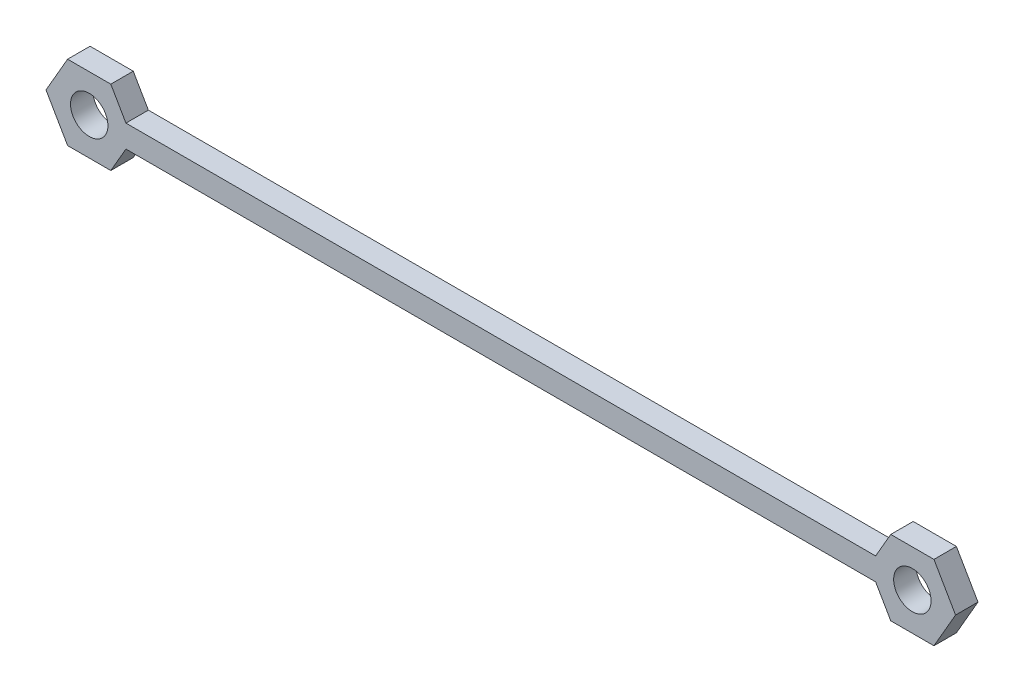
from build123d import *

# Parameters (mm, degrees)
CROQUIS1_R              = 2.5
SALIENTE_EXTRUIR1_DEPTH = 1.5


with BuildPart() as part:
    # Croquis1 → Saliente-Extruir1 (new, symmetric)
    with BuildSketch(Plane.XY):
        Polygon((-52.113248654, 5), (-57.886751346, 5), (-60.773502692, 0), (-57.886751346, -5), (-52.113248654, -5), (-50.092522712, -1.5), (50.092522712, -1.5), (52.113248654, -5), (57.886751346, -5), (60.773502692, 0), (57.886751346, 5), (52.113248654, 5), (50.092522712, 1.5), (-50.092522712, 1.5), align=None)
        with Locations((-55, 0)):
            Circle(CROQUIS1_R, mode=Mode.SUBTRACT)
        with Locations((55, 0)):
            Circle(CROQUIS1_R, mode=Mode.SUBTRACT)
    extrude(amount=SALIENTE_EXTRUIR1_DEPTH, both=True)


solid = part.part
